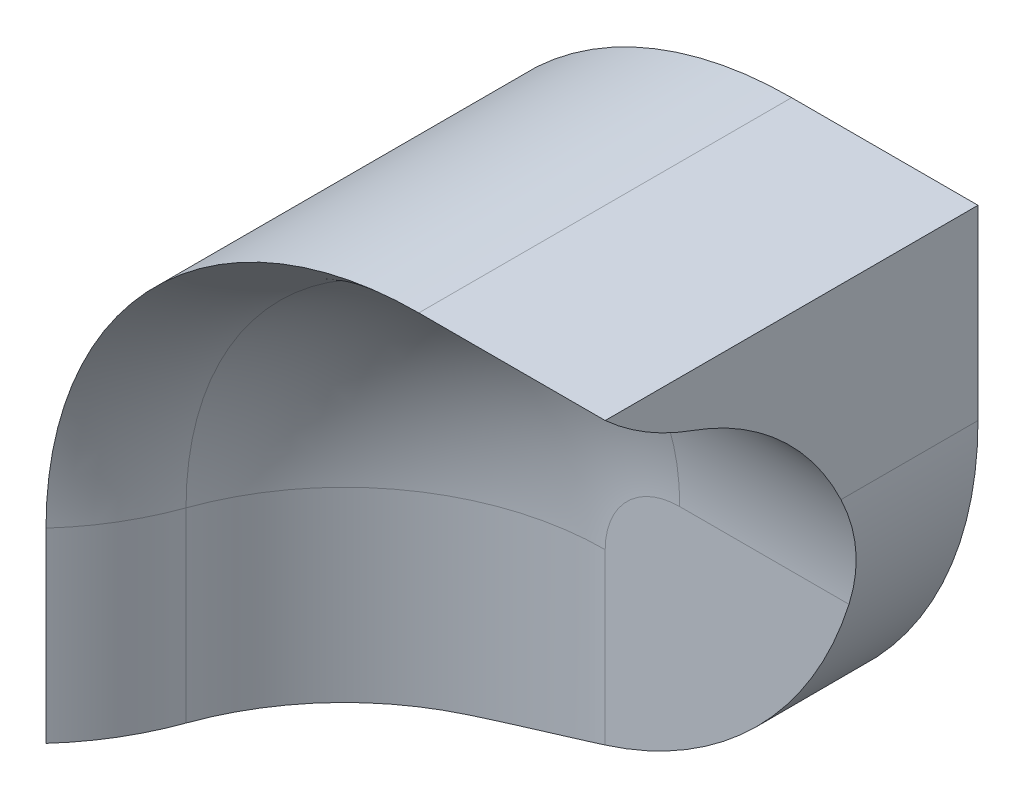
ISO-10303-21;
HEADER;
FILE_DESCRIPTION(('STEP AP214'),'2;1');
FILE_NAME('part.step','',(''),(''),'','','');
FILE_SCHEMA(('AUTOMOTIVE_DESIGN { 1 0 10303 214 1 1 1 1 }'));
ENDSEC;
DATA;
#1=APPLICATION_CONTEXT('core data for automotive mechanical design processes');
#2=APPLICATION_PROTOCOL_DEFINITION('international standard','automotive_design',2000,#1);
#3=PRODUCT_CONTEXT('',#1,'mechanical');
#4=PRODUCT('Part','Part','',(#3));
#5=PRODUCT_RELATED_PRODUCT_CATEGORY('part','',(#4));
#6=PRODUCT_DEFINITION_FORMATION('','',#4);
#7=PRODUCT_DEFINITION_CONTEXT('part definition',#1,'design');
#8=PRODUCT_DEFINITION('design','',#6,#7);
#9=PRODUCT_DEFINITION_SHAPE('','',#8);
#10=(LENGTH_UNIT() NAMED_UNIT(*) SI_UNIT(.MILLI.,.METRE.));
#11=(NAMED_UNIT(*) PLANE_ANGLE_UNIT() SI_UNIT($,.RADIAN.));
#12=(NAMED_UNIT(*) SI_UNIT($,.STERADIAN.) SOLID_ANGLE_UNIT());
#13=UNCERTAINTY_MEASURE_WITH_UNIT(LENGTH_MEASURE(1.E-05),#10,'distance_accuracy_value','');
#14=(GEOMETRIC_REPRESENTATION_CONTEXT(3) GLOBAL_UNCERTAINTY_ASSIGNED_CONTEXT((#13)) GLOBAL_UNIT_ASSIGNED_CONTEXT((#10,
#11,#12)) REPRESENTATION_CONTEXT('',''));
#15=CARTESIAN_POINT('',(0.,0.,0.));
#16=DIRECTION('',(0.,0.,1.));
#17=DIRECTION('',(1.,0.,0.));
#18=AXIS2_PLACEMENT_3D('',#15,#16,#17);
#19=CARTESIAN_POINT('',(2.5,-2.5,10.));
#20=DIRECTION('',(0.,0.,-1.));
#21=DIRECTION('',(-1.,0.,0.));
#22=AXIS2_PLACEMENT_3D('',#19,#20,#21);
#23=DEGENERATE_TOROIDAL_SURFACE('',#22,2.,7.,.T.);
#24=CARTESIAN_POINT('',(2.5,-0.5,10.));
#25=DIRECTION('',(-1.,0.,0.));
#26=DIRECTION('',(0.,-1.,0.));
#27=AXIS2_PLACEMENT_3D('',#24,#25,#26);
#28=CIRCLE('',#27,7.);
#29=CARTESIAN_POINT('',(2.5,6.09375,7.65000831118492));
#30=VERTEX_POINT('',#29);
#31=CARTESIAN_POINT('',(2.5,-0.5,3.));
#32=VERTEX_POINT('',#31);
#33=EDGE_CURVE('E236',#30,#32,#28,.T.);
#34=ORIENTED_EDGE('',*,*,#33,.F.);
#35=CARTESIAN_POINT('',(2.5,-2.5,7.65000831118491));
#36=DIRECTION('',(0.,0.,1.));
#37=DIRECTION('',(1.,0.,0.));
#38=AXIS2_PLACEMENT_3D('',#35,#36,#37);
#39=CIRCLE('',#38,8.59375);
#40=CARTESIAN_POINT('',(-6.09375,-2.5,7.65000831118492));
#41=VERTEX_POINT('',#40);
#42=EDGE_CURVE('E11',#30,#41,#39,.T.);
#43=ORIENTED_EDGE('',*,*,#42,.T.);
#44=CARTESIAN_POINT('',(0.5,-2.5,10.));
#45=DIRECTION('',(0.,-1.,0.));
#46=DIRECTION('',(1.,0.,0.));
#47=AXIS2_PLACEMENT_3D('',#44,#45,#46);
#48=CIRCLE('',#47,7.);
#49=CARTESIAN_POINT('',(0.5,-2.5,3.));
#50=VERTEX_POINT('',#49);
#51=EDGE_CURVE('E246',#41,#50,#48,.T.);
#52=ORIENTED_EDGE('',*,*,#51,.T.);
#53=CARTESIAN_POINT('',(2.5,-2.5,3.));
#54=DIRECTION('',(0.,0.,-1.));
#55=DIRECTION('',(-1.,0.,0.));
#56=AXIS2_PLACEMENT_3D('',#53,#54,#55);
#57=CIRCLE('',#56,2.);
#58=EDGE_CURVE('E190',#32,#50,#57,.F.);
#59=ORIENTED_EDGE('',*,*,#58,.F.);
#60=EDGE_LOOP('',(#34,#43,#52,#59));
#61=FACE_BOUND('',#60,.T.);
#62=ADVANCED_FACE('F45',(#61),#23,.F.);
#63=CARTESIAN_POINT('',(0.5,-2.5,10.));
#64=DIRECTION('',(0.,-1.,0.));
#65=DIRECTION('',(1.,0.,0.));
#66=AXIS2_PLACEMENT_3D('',#63,#64,#65);
#67=CYLINDRICAL_SURFACE('',#66,7.);
#68=ORIENTED_EDGE('',*,*,#51,.F.);
#69=DIRECTION('',(0.,-1.,0.));
#70=VECTOR('',#69,1.);
#71=CARTESIAN_POINT('',(-6.09375,-2.5,7.65000831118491));
#72=LINE('',#71,#70);
#73=CARTESIAN_POINT('',(-6.09375,-7.5,7.65000831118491));
#74=VERTEX_POINT('',#73);
#75=EDGE_CURVE('E129',#41,#74,#72,.T.);
#76=ORIENTED_EDGE('',*,*,#75,.T.);
#77=CARTESIAN_POINT('',(0.5,-7.5,10.));
#78=DIRECTION('',(0.,1.,0.));
#79=DIRECTION('',(0.,0.,1.));
#80=AXIS2_PLACEMENT_3D('',#77,#78,#79);
#81=CIRCLE('',#80,7.);
#82=CARTESIAN_POINT('',(-2.5,-7.5,3.67544467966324));
#83=VERTEX_POINT('',#82);
#84=EDGE_CURVE('E207',#74,#83,#81,.F.);
#85=ORIENTED_EDGE('',*,*,#84,.T.);
#86=CARTESIAN_POINT('',(0.499999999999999,-7.03939201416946,3.));
#87=CARTESIAN_POINT('',(0.338050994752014,-7.09035956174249,2.99996786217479));
#88=CARTESIAN_POINT('',(0.174759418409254,-7.13714432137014,3.00561935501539));
#89=CARTESIAN_POINT('',(-0.153228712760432,-7.22220043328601,3.02861543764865));
#90=CARTESIAN_POINT('',(-0.317925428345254,-7.26047079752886,3.04596138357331));
#91=CARTESIAN_POINT('',(-0.642801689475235,-7.3273900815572,3.09201967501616));
#92=CARTESIAN_POINT('',(-0.802978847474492,-7.35627799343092,3.12040082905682));
#93=CARTESIAN_POINT('',(-1.12212653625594,-7.40593400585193,3.18858903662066));
#94=CARTESIAN_POINT('',(-1.28109726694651,-7.42670348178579,3.22839415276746));
#95=CARTESIAN_POINT('',(-1.59653155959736,-7.460366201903,3.31931999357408));
#96=CARTESIAN_POINT('',(-1.75299627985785,-7.47326319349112,3.37043531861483));
#97=CARTESIAN_POINT('',(-2.06234034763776,-7.49162029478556,3.4837465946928));
#98=CARTESIAN_POINT('',(-2.21521890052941,-7.49707877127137,3.54594497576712));
#99=CARTESIAN_POINT('',(-2.520599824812,-7.50117679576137,3.68297813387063));
#100=CARTESIAN_POINT('',(-2.67296434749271,-7.49961526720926,3.75812545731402));
#101=CARTESIAN_POINT('',(-2.97162771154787,-7.48999455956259,3.91915583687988));
#102=CARTESIAN_POINT('',(-3.11792883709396,-7.48193785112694,4.0050348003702));
#103=CARTESIAN_POINT('',(-3.26071910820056,-7.47102333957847,4.09601898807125));
#104=B_SPLINE_CURVE_WITH_KNOTS('',3,(#86,#87,#88,#89,#90,#91,#92,#93,#94,#95,#96,#97,#98,#99,
#100,#101,#102,#103),.UNSPECIFIED.,.F.,.F.,(4,2,2,2,2,2,2,2,4),(0.,0.509226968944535,
1.01851299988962,1.51356655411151,2.00853620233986,2.50327005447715,2.99811251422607,
3.50721780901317,4.01612953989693),.UNSPECIFIED.);
#105=CARTESIAN_POINT('',(0.499999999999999,-7.03939201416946,3.));
#106=VERTEX_POINT('',#105);
#107=EDGE_CURVE('E198',#106,#83,#104,.T.);
#108=ORIENTED_EDGE('',*,*,#107,.F.);
#109=DIRECTION('',(0.,1.,0.));
#110=VECTOR('',#109,1.);
#111=CARTESIAN_POINT('',(0.5,-2.5,3.));
#112=LINE('',#111,#110);
#113=EDGE_CURVE('E193',#50,#106,#112,.F.);
#114=ORIENTED_EDGE('',*,*,#113,.F.);
#115=EDGE_LOOP('',(#68,#76,#85,#108,#114));
#116=FACE_BOUND('',#115,.T.);
#117=ADVANCED_FACE('F213',(#116),#67,.F.);
#118=CARTESIAN_POINT('',(7.5,-0.5,10.));
#119=DIRECTION('',(-1.,0.,0.));
#120=DIRECTION('',(0.,0.,1.));
#121=AXIS2_PLACEMENT_3D('',#118,#119,#120);
#122=CYLINDRICAL_SURFACE('',#121,7.);
#123=CARTESIAN_POINT('',(7.5,-0.5,10.));
#124=DIRECTION('',(-1.,0.,0.));
#125=DIRECTION('',(0.,0.,1.));
#126=AXIS2_PLACEMENT_3D('',#123,#124,#125);
#127=CIRCLE('',#126,7.);
#128=CARTESIAN_POINT('',(7.5,6.09375,7.65000831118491));
#129=VERTEX_POINT('',#128);
#130=CARTESIAN_POINT('',(7.5,2.5,3.67544467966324));
#131=VERTEX_POINT('',#130);
#132=EDGE_CURVE('E196',#129,#131,#127,.T.);
#133=ORIENTED_EDGE('',*,*,#132,.F.);
#134=DIRECTION('',(-1.,0.,0.));
#135=VECTOR('',#134,1.);
#136=CARTESIAN_POINT('',(7.5,6.09375,7.65000831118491));
#137=LINE('',#136,#135);
#138=EDGE_CURVE('E54',#129,#30,#137,.T.);
#139=ORIENTED_EDGE('',*,*,#138,.T.);
#140=ORIENTED_EDGE('',*,*,#33,.T.);
#141=DIRECTION('',(1.,0.,0.));
#142=VECTOR('',#141,1.);
#143=CARTESIAN_POINT('',(7.5,-0.5,3.));
#144=LINE('',#143,#142);
#145=CARTESIAN_POINT('',(7.03939201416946,-0.500000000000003,3.));
#146=VERTEX_POINT('',#145);
#147=EDGE_CURVE('E187',#146,#32,#144,.F.);
#148=ORIENTED_EDGE('',*,*,#147,.F.);
#149=CARTESIAN_POINT('',(7.5,2.5,3.67544467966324));
#150=CARTESIAN_POINT('',(7.50002928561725,2.3465246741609,3.60260898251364));
#151=CARTESIAN_POINT('',(7.49646790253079,2.1903503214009,3.53540813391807));
#152=CARTESIAN_POINT('',(7.48162648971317,1.87383749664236,3.41261876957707));
#153=CARTESIAN_POINT('',(7.47034543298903,1.71349847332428,3.35703180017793));
#154=CARTESIAN_POINT('',(7.43995808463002,1.39445703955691,3.25921976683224));
#155=CARTESIAN_POINT('',(7.42107950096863,1.23583429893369,3.21666444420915));
#156=CARTESIAN_POINT('',(7.37524387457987,0.917135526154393,3.14299900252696));
#157=CARTESIAN_POINT('',(7.34828829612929,0.757059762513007,3.11188681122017));
#158=CARTESIAN_POINT('',(7.28619940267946,0.436775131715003,3.06107126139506));
#159=CARTESIAN_POINT('',(7.25107032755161,0.276566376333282,3.04136200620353));
#160=CARTESIAN_POINT('',(7.17268503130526,-0.0428781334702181,3.01310059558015));
#161=CARTESIAN_POINT('',(7.12942687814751,-0.202113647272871,3.00455109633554));
#162=CARTESIAN_POINT('',(7.03364273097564,-0.522987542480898,2.99814736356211));
#163=CARTESIAN_POINT('',(6.98088548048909,-0.684562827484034,3.00060861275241));
#164=CARTESIAN_POINT('',(6.86743580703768,-1.00429241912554,3.01634885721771));
#165=CARTESIAN_POINT('',(6.80674687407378,-1.16244819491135,3.02962310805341));
#166=CARTESIAN_POINT('',(6.7422856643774,-1.31839700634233,3.04800558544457));
#167=B_SPLINE_CURVE_WITH_KNOTS('',3,(#149,#150,#151,#152,#153,#154,#155,#156,#157,#158,#159,
#160,#161,#162,#163,#164,#165,#166),.UNSPECIFIED.,.F.,.F.,(4,2,2,2,2,2,2,2,4),(0.,
0.509528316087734,1.01912443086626,1.51446649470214,2.00971881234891,2.50471479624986,
2.99982857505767,3.5092179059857,4.01838385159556),.UNSPECIFIED.);
#168=EDGE_CURVE('E228',#146,#131,#167,.F.);
#169=ORIENTED_EDGE('',*,*,#168,.T.);
#170=EDGE_LOOP('',(#133,#139,#140,#148,#169));
#171=FACE_BOUND('',#170,.T.);
#172=ADVANCED_FACE('F218',(#171),#122,.F.);
#173=CARTESIAN_POINT('',(2.5,-2.5,3.));
#174=DIRECTION('',(0.,0.,-1.));
#175=DIRECTION('',(-1.,0.,0.));
#176=AXIS2_PLACEMENT_3D('',#173,#174,#175);
#177=PLANE('',#176);
#178=ORIENTED_EDGE('',*,*,#58,.T.);
#179=ORIENTED_EDGE('',*,*,#113,.T.);
#180=CARTESIAN_POINT('',(-2.5,2.5,3.));
#181=DIRECTION('',(0.,0.,1.));
#182=DIRECTION('',(1.,0.,0.));
#183=AXIS2_PLACEMENT_3D('',#180,#181,#182);
#184=CIRCLE('',#183,10.);
#185=EDGE_CURVE('E162',#106,#146,#184,.T.);
#186=ORIENTED_EDGE('',*,*,#185,.T.);
#187=ORIENTED_EDGE('',*,*,#147,.T.);
#188=EDGE_LOOP('',(#178,#179,#186,#187));
#189=FACE_BOUND('',#188,.T.);
#190=ADVANCED_FACE('F225',(#189),#177,.F.);
#191=CARTESIAN_POINT('',(7.5,2.5,3.));
#192=DIRECTION('',(-1.,0.,0.));
#193=DIRECTION('',(0.,0.,1.));
#194=AXIS2_PLACEMENT_3D('',#191,#192,#193);
#195=PLANE('',#194);
#196=DIRECTION('',(0.,0.,-1.));
#197=VECTOR('',#196,1.);
#198=CARTESIAN_POINT('',(7.5,7.5,3.));
#199=LINE('',#198,#197);
#200=CARTESIAN_POINT('',(7.5,7.5,10.));
#201=VERTEX_POINT('',#200);
#202=CARTESIAN_POINT('',(7.5,7.5,0.));
#203=VERTEX_POINT('',#202);
#204=EDGE_CURVE('E184',#201,#203,#199,.T.);
#205=ORIENTED_EDGE('',*,*,#204,.F.);
#206=CARTESIAN_POINT('',(7.5,12.6875,5.30001662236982));
#207=DIRECTION('',(-1.,0.,0.));
#208=DIRECTION('',(0.,0.,1.));
#209=AXIS2_PLACEMENT_3D('',#206,#207,#208);
#210=CIRCLE('',#209,7.);
#211=EDGE_CURVE('E69',#201,#129,#210,.F.);
#212=ORIENTED_EDGE('',*,*,#211,.T.);
#213=ORIENTED_EDGE('',*,*,#132,.T.);
#214=DIRECTION('',(0.,0.,-1.));
#215=VECTOR('',#214,1.);
#216=CARTESIAN_POINT('',(7.5,2.5,3.));
#217=LINE('',#216,#215);
#218=CARTESIAN_POINT('',(7.5,2.5,0.));
#219=VERTEX_POINT('',#218);
#220=EDGE_CURVE('E165',#131,#219,#217,.T.);
#221=ORIENTED_EDGE('',*,*,#220,.T.);
#222=DIRECTION('',(0.,1.,0.));
#223=VECTOR('',#222,1.);
#224=CARTESIAN_POINT('',(7.5,2.5,0.));
#225=LINE('',#224,#223);
#226=EDGE_CURVE('E158',#219,#203,#225,.T.);
#227=ORIENTED_EDGE('',*,*,#226,.T.);
#228=EDGE_LOOP('',(#205,#212,#213,#221,#227));
#229=FACE_BOUND('',#228,.T.);
#230=ADVANCED_FACE('F220',(#229),#195,.F.);
#231=CARTESIAN_POINT('',(2.5,7.5,3.));
#232=DIRECTION('',(0.,-1.,0.));
#233=DIRECTION('',(0.,0.,-1.));
#234=AXIS2_PLACEMENT_3D('',#231,#232,#233);
#235=PLANE('',#234);
#236=DIRECTION('',(-1.,0.,0.));
#237=VECTOR('',#236,1.);
#238=CARTESIAN_POINT('',(2.5,7.5,0.));
#239=LINE('',#238,#237);
#240=CARTESIAN_POINT('',(2.5,7.5,0.));
#241=VERTEX_POINT('',#240);
#242=EDGE_CURVE('E169',#203,#241,#239,.T.);
#243=ORIENTED_EDGE('',*,*,#242,.T.);
#244=DIRECTION('',(0.,0.,-1.));
#245=VECTOR('',#244,1.);
#246=CARTESIAN_POINT('',(2.5,7.5,3.));
#247=LINE('',#246,#245);
#248=CARTESIAN_POINT('',(2.5,7.5,10.));
#249=VERTEX_POINT('',#248);
#250=EDGE_CURVE('E150',#249,#241,#247,.T.);
#251=ORIENTED_EDGE('',*,*,#250,.F.);
#252=DIRECTION('',(-1.,0.,0.));
#253=VECTOR('',#252,1.);
#254=CARTESIAN_POINT('',(7.5,7.5,10.));
#255=LINE('',#254,#253);
#256=EDGE_CURVE('E156',#201,#249,#255,.T.);
#257=ORIENTED_EDGE('',*,*,#256,.F.);
#258=ORIENTED_EDGE('',*,*,#204,.T.);
#259=EDGE_LOOP('',(#243,#251,#257,#258));
#260=FACE_BOUND('',#259,.T.);
#261=ADVANCED_FACE('F259',(#260),#235,.F.);
#262=CARTESIAN_POINT('',(2.5,-2.5,3.));
#263=DIRECTION('',(0.,0.,-1.));
#264=DIRECTION('',(-1.,0.,0.));
#265=AXIS2_PLACEMENT_3D('',#262,#263,#264);
#266=CYLINDRICAL_SURFACE('',#265,10.);
#267=CARTESIAN_POINT('',(2.5,-2.5,0.));
#268=DIRECTION('',(0.,0.,1.));
#269=DIRECTION('',(-1.,0.,0.));
#270=AXIS2_PLACEMENT_3D('',#267,#268,#269);
#271=CIRCLE('',#270,10.);
#272=CARTESIAN_POINT('',(-7.5,-2.5,0.));
#273=VERTEX_POINT('',#272);
#274=EDGE_CURVE('E147',#241,#273,#271,.T.);
#275=ORIENTED_EDGE('',*,*,#274,.T.);
#276=DIRECTION('',(0.,0.,-1.));
#277=VECTOR('',#276,1.);
#278=CARTESIAN_POINT('',(-7.5,-2.5,3.));
#279=LINE('',#278,#277);
#280=CARTESIAN_POINT('',(-7.5,-2.5,10.));
#281=VERTEX_POINT('',#280);
#282=EDGE_CURVE('E144',#281,#273,#279,.T.);
#283=ORIENTED_EDGE('',*,*,#282,.F.);
#284=CARTESIAN_POINT('',(2.5,-2.5,10.));
#285=DIRECTION('',(0.,0.,1.));
#286=DIRECTION('',(1.,0.,0.));
#287=AXIS2_PLACEMENT_3D('',#284,#285,#286);
#288=CIRCLE('',#287,10.);
#289=EDGE_CURVE('E135',#249,#281,#288,.T.);
#290=ORIENTED_EDGE('',*,*,#289,.F.);
#291=ORIENTED_EDGE('',*,*,#250,.T.);
#292=EDGE_LOOP('',(#275,#283,#290,#291));
#293=FACE_BOUND('',#292,.T.);
#294=ADVANCED_FACE('F145',(#293),#266,.T.);
#295=CARTESIAN_POINT('',(-7.5,-7.5,3.));
#296=DIRECTION('',(1.,0.,0.));
#297=DIRECTION('',(0.,0.,-1.));
#298=AXIS2_PLACEMENT_3D('',#295,#296,#297);
#299=PLANE('',#298);
#300=DIRECTION('',(0.,-1.,0.));
#301=VECTOR('',#300,1.);
#302=CARTESIAN_POINT('',(-7.5,-7.5,0.));
#303=LINE('',#302,#301);
#304=CARTESIAN_POINT('',(-7.5,-7.5,0.));
#305=VERTEX_POINT('',#304);
#306=EDGE_CURVE('E172',#273,#305,#303,.T.);
#307=ORIENTED_EDGE('',*,*,#306,.T.);
#308=DIRECTION('',(0.,0.,-1.));
#309=VECTOR('',#308,1.);
#310=CARTESIAN_POINT('',(-7.5,-7.5,3.));
#311=LINE('',#310,#309);
#312=CARTESIAN_POINT('',(-7.5,-7.5,10.));
#313=VERTEX_POINT('',#312);
#314=EDGE_CURVE('E151',#313,#305,#311,.T.);
#315=ORIENTED_EDGE('',*,*,#314,.F.);
#316=DIRECTION('',(0.,-1.,0.));
#317=VECTOR('',#316,1.);
#318=CARTESIAN_POINT('',(-7.5,-2.5,10.));
#319=LINE('',#318,#317);
#320=EDGE_CURVE('E128',#281,#313,#319,.T.);
#321=ORIENTED_EDGE('',*,*,#320,.F.);
#322=ORIENTED_EDGE('',*,*,#282,.T.);
#323=EDGE_LOOP('',(#307,#315,#321,#322));
#324=FACE_BOUND('',#323,.T.);
#325=ADVANCED_FACE('F154',(#324),#299,.F.);
#326=CARTESIAN_POINT('',(-7.5,-7.5,3.));
#327=DIRECTION('',(0.,1.,0.));
#328=DIRECTION('',(0.,0.,1.));
#329=AXIS2_PLACEMENT_3D('',#326,#327,#328);
#330=PLANE('',#329);
#331=ORIENTED_EDGE('',*,*,#84,.F.);
#332=CARTESIAN_POINT('',(-12.6875,-7.5,5.30001662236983));
#333=DIRECTION('',(0.,1.,0.));
#334=DIRECTION('',(0.,0.,1.));
#335=AXIS2_PLACEMENT_3D('',#332,#333,#334);
#336=CIRCLE('',#335,7.);
#337=EDGE_CURVE('E238',#74,#313,#336,.F.);
#338=ORIENTED_EDGE('',*,*,#337,.T.);
#339=ORIENTED_EDGE('',*,*,#314,.T.);
#340=DIRECTION('',(1.,0.,0.));
#341=VECTOR('',#340,1.);
#342=CARTESIAN_POINT('',(-7.5,-7.5,0.));
#343=LINE('',#342,#341);
#344=CARTESIAN_POINT('',(-2.5,-7.5,0.));
#345=VERTEX_POINT('',#344);
#346=EDGE_CURVE('E174',#305,#345,#343,.T.);
#347=ORIENTED_EDGE('',*,*,#346,.T.);
#348=DIRECTION('',(0.,0.,-1.));
#349=VECTOR('',#348,1.);
#350=CARTESIAN_POINT('',(-2.5,-7.5,3.));
#351=LINE('',#350,#349);
#352=EDGE_CURVE('E179',#83,#345,#351,.T.);
#353=ORIENTED_EDGE('',*,*,#352,.F.);
#354=EDGE_LOOP('',(#331,#338,#339,#347,#353));
#355=FACE_BOUND('',#354,.T.);
#356=ADVANCED_FACE('F243',(#355),#330,.F.);
#357=CARTESIAN_POINT('',(-2.5,2.5,3.));
#358=DIRECTION('',(0.,0.,-1.));
#359=DIRECTION('',(-1.,0.,0.));
#360=AXIS2_PLACEMENT_3D('',#357,#358,#359);
#361=CYLINDRICAL_SURFACE('',#360,10.);
#362=CARTESIAN_POINT('',(-2.5,2.5,0.));
#363=DIRECTION('',(0.,0.,1.));
#364=DIRECTION('',(1.,0.,0.));
#365=AXIS2_PLACEMENT_3D('',#362,#363,#364);
#366=CIRCLE('',#365,10.);
#367=EDGE_CURVE('E166',#345,#219,#366,.T.);
#368=ORIENTED_EDGE('',*,*,#367,.T.);
#369=ORIENTED_EDGE('',*,*,#220,.F.);
#370=ORIENTED_EDGE('',*,*,#168,.F.);
#371=ORIENTED_EDGE('',*,*,#185,.F.);
#372=ORIENTED_EDGE('',*,*,#107,.T.);
#373=ORIENTED_EDGE('',*,*,#352,.T.);
#374=EDGE_LOOP('',(#368,#369,#370,#371,#372,#373));
#375=FACE_BOUND('',#374,.T.);
#376=ADVANCED_FACE('F209',(#375),#361,.T.);
#377=CARTESIAN_POINT('',(2.5,-2.5,0.));
#378=DIRECTION('',(0.,0.,-1.));
#379=DIRECTION('',(-1.,0.,0.));
#380=AXIS2_PLACEMENT_3D('',#377,#378,#379);
#381=PLANE('',#380);
#382=CARTESIAN_POINT('',(-2.44974746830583,2.44974746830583,0.));
#383=DIRECTION('',(0.,0.,-1.));
#384=DIRECTION('',(-1.,0.,0.));
#385=AXIS2_PLACEMENT_3D('',#382,#383,#384);
#386=CIRCLE('',#385,2.05);
#387=CARTESIAN_POINT('',(-4.49974746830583,2.44974746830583,0.));
#388=VERTEX_POINT('',#387);
#389=EDGE_CURVE('E364',#388,#388,#386,.T.);
#390=ORIENTED_EDGE('',*,*,#389,.F.);
#391=EDGE_LOOP('',(#390));
#392=FACE_BOUND('',#391,.T.);
#393=CARTESIAN_POINT('',(2.55025253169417,-2.55025253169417,0.));
#394=DIRECTION('',(0.,0.,-1.));
#395=DIRECTION('',(-1.,0.,0.));
#396=AXIS2_PLACEMENT_3D('',#393,#394,#395);
#397=CIRCLE('',#396,2.05);
#398=CARTESIAN_POINT('',(0.500252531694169,-2.55025253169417,0.));
#399=VERTEX_POINT('',#398);
#400=EDGE_CURVE('E367',#399,#399,#397,.T.);
#401=ORIENTED_EDGE('',*,*,#400,.F.);
#402=EDGE_LOOP('',(#401));
#403=FACE_BOUND('',#402,.T.);
#404=ORIENTED_EDGE('',*,*,#226,.F.);
#405=ORIENTED_EDGE('',*,*,#367,.F.);
#406=ORIENTED_EDGE('',*,*,#346,.F.);
#407=ORIENTED_EDGE('',*,*,#306,.F.);
#408=ORIENTED_EDGE('',*,*,#274,.F.);
#409=ORIENTED_EDGE('',*,*,#242,.F.);
#410=EDGE_LOOP('',(#404,#405,#406,#407,#408,#409));
#411=FACE_BOUND('',#410,.T.);
#412=ADVANCED_FACE('F262',(#392,#403,#411),#381,.T.);
#413=CARTESIAN_POINT('',(7.5,12.6875,5.30001662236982));
#414=DIRECTION('',(1.,0.,0.));
#415=DIRECTION('',(0.,0.,-1.));
#416=AXIS2_PLACEMENT_3D('',#413,#414,#415);
#417=CYLINDRICAL_SURFACE('',#416,7.);
#418=ORIENTED_EDGE('',*,*,#211,.F.);
#419=ORIENTED_EDGE('',*,*,#256,.T.);
#420=CARTESIAN_POINT('',(2.5,12.6875,5.30001662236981));
#421=DIRECTION('',(-1.,0.,0.));
#422=DIRECTION('',(0.,0.,1.));
#423=AXIS2_PLACEMENT_3D('',#420,#421,#422);
#424=CIRCLE('',#423,7.);
#425=EDGE_CURVE('E49',#30,#249,#424,.T.);
#426=ORIENTED_EDGE('',*,*,#425,.F.);
#427=ORIENTED_EDGE('',*,*,#138,.F.);
#428=EDGE_LOOP('',(#418,#419,#426,#427));
#429=FACE_BOUND('',#428,.T.);
#430=ADVANCED_FACE('F47',(#429),#417,.T.);
#431=CARTESIAN_POINT('',(2.5,-2.5,5.30001662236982));
#432=DIRECTION('',(0.,0.,1.));
#433=DIRECTION('',(1.,0.,0.));
#434=AXIS2_PLACEMENT_3D('',#431,#432,#433);
#435=TOROIDAL_SURFACE('',#434,15.1875,7.);
#436=ORIENTED_EDGE('',*,*,#425,.T.);
#437=ORIENTED_EDGE('',*,*,#289,.T.);
#438=CARTESIAN_POINT('',(-12.6875,-2.5,5.30001662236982));
#439=DIRECTION('',(0.,-1.,0.));
#440=DIRECTION('',(0.,0.,-1.));
#441=AXIS2_PLACEMENT_3D('',#438,#439,#440);
#442=CIRCLE('',#441,7.);
#443=EDGE_CURVE('E123',#41,#281,#442,.T.);
#444=ORIENTED_EDGE('',*,*,#443,.F.);
#445=ORIENTED_EDGE('',*,*,#42,.F.);
#446=EDGE_LOOP('',(#436,#437,#444,#445));
#447=FACE_BOUND('',#446,.T.);
#448=ADVANCED_FACE('F137',(#447),#435,.T.);
#449=CARTESIAN_POINT('',(-12.6875,-2.5,5.30001662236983));
#450=DIRECTION('',(0.,1.,0.));
#451=DIRECTION('',(0.,0.,1.));
#452=AXIS2_PLACEMENT_3D('',#449,#450,#451);
#453=CYLINDRICAL_SURFACE('',#452,7.);
#454=ORIENTED_EDGE('',*,*,#337,.F.);
#455=ORIENTED_EDGE('',*,*,#75,.F.);
#456=ORIENTED_EDGE('',*,*,#443,.T.);
#457=ORIENTED_EDGE('',*,*,#320,.T.);
#458=EDGE_LOOP('',(#454,#455,#456,#457));
#459=FACE_BOUND('',#458,.T.);
#460=ADVANCED_FACE('F126',(#459),#453,.T.);
#461=CARTESIAN_POINT('',(2.55025253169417,-2.55025253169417,1.7));
#462=DIRECTION('',(0.,0.,-1.));
#463=DIRECTION('',(-1.,0.,0.));
#464=AXIS2_PLACEMENT_3D('',#461,#462,#463);
#465=CYLINDRICAL_SURFACE('',#464,2.05);
#466=CARTESIAN_POINT('',(2.55025253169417,-2.55025253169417,1.7));
#467=DIRECTION('',(0.,0.,-1.));
#468=DIRECTION('',(-1.,0.,0.));
#469=AXIS2_PLACEMENT_3D('',#466,#467,#468);
#470=CIRCLE('',#469,2.05);
#471=CARTESIAN_POINT('',(0.500252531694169,-2.55025253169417,1.7));
#472=VERTEX_POINT('',#471);
#473=EDGE_CURVE('E369',#472,#472,#470,.T.);
#474=ORIENTED_EDGE('',*,*,#473,.F.);
#475=EDGE_LOOP('',(#474));
#476=FACE_BOUND('',#475,.T.);
#477=ORIENTED_EDGE('',*,*,#400,.T.);
#478=EDGE_LOOP('',(#477));
#479=FACE_BOUND('',#478,.T.);
#480=ADVANCED_FACE('F315',(#476,#479),#465,.F.);
#481=CARTESIAN_POINT('',(2.55025253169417,-2.55025253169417,1.7));
#482=DIRECTION('',(0.,0.,-1.));
#483=DIRECTION('',(-1.,0.,0.));
#484=AXIS2_PLACEMENT_3D('',#481,#482,#483);
#485=PLANE('',#484);
#486=ORIENTED_EDGE('',*,*,#473,.T.);
#487=EDGE_LOOP('',(#486));
#488=FACE_BOUND('',#487,.T.);
#489=ADVANCED_FACE('F325',(#488),#485,.T.);
#490=CARTESIAN_POINT('',(-2.44974746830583,2.44974746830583,1.7));
#491=DIRECTION('',(0.,0.,-1.));
#492=DIRECTION('',(-1.,0.,0.));
#493=AXIS2_PLACEMENT_3D('',#490,#491,#492);
#494=CYLINDRICAL_SURFACE('',#493,2.05);
#495=CARTESIAN_POINT('',(-2.44974746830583,2.44974746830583,1.7));
#496=DIRECTION('',(0.,0.,-1.));
#497=DIRECTION('',(-1.,0.,0.));
#498=AXIS2_PLACEMENT_3D('',#495,#496,#497);
#499=CIRCLE('',#498,2.05);
#500=CARTESIAN_POINT('',(-4.49974746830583,2.44974746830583,1.7));
#501=VERTEX_POINT('',#500);
#502=EDGE_CURVE('E132',#501,#501,#499,.T.);
#503=ORIENTED_EDGE('',*,*,#502,.F.);
#504=EDGE_LOOP('',(#503));
#505=FACE_BOUND('',#504,.T.);
#506=ORIENTED_EDGE('',*,*,#389,.T.);
#507=EDGE_LOOP('',(#506));
#508=FACE_BOUND('',#507,.T.);
#509=ADVANCED_FACE('F335',(#505,#508),#494,.F.);
#510=CARTESIAN_POINT('',(-2.44974746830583,2.44974746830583,1.7));
#511=DIRECTION('',(0.,0.,-1.));
#512=DIRECTION('',(-1.,0.,0.));
#513=AXIS2_PLACEMENT_3D('',#510,#511,#512);
#514=PLANE('',#513);
#515=ORIENTED_EDGE('',*,*,#502,.T.);
#516=EDGE_LOOP('',(#515));
#517=FACE_BOUND('',#516,.T.);
#518=ADVANCED_FACE('F345',(#517),#514,.T.);
#519=CLOSED_SHELL('',(#62,#117,#172,#190,#230,#261,#294,#325,#356,#376,#412,#430,#448,#460,#480,
#489,#509,#518));
#520=MANIFOLD_SOLID_BREP('B2',#519);
#521=ADVANCED_BREP_SHAPE_REPRESENTATION('',(#18,#520),#14);
#522=SHAPE_DEFINITION_REPRESENTATION(#9,#521);
ENDSEC;
END-ISO-10303-21;
